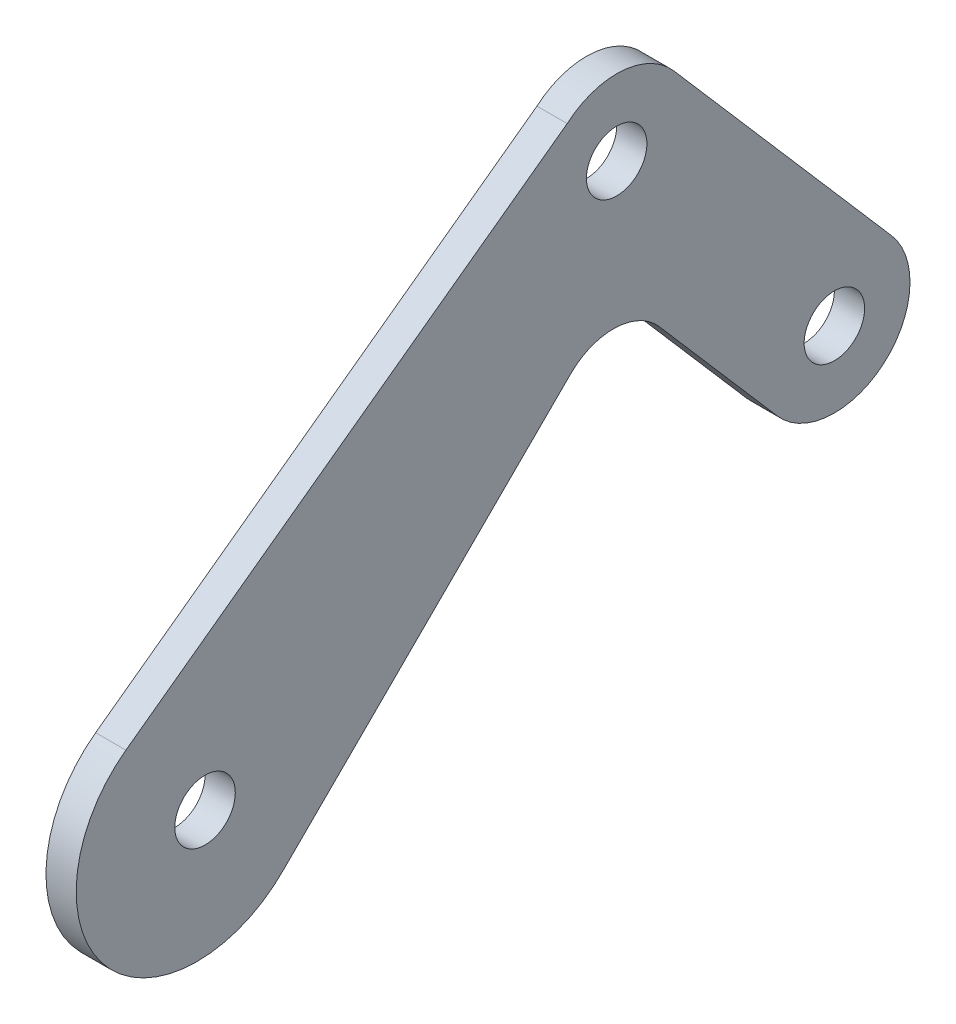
from build123d import *

# Parameters (mm, degrees)
SKETCH1_R           = 3.175
BOSS_EXTRUDE1_DEPTH = 1.5875


with BuildPart() as part:
    # Sketch1 → Boss-Extrude1 (new, symmetric)
    with BuildSketch(Plane(origin=(0, 0, 0), x_dir=(0, 0, -1), z_dir=(1, 0, 0))):
        with BuildLine():
            Line((16.854121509, -31.602185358), (4.456348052, -17.277795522))
            ThreePointArc((4.456348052, -17.277795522), (-0.109725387, -15.087769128), (-4.825463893, -16.933589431))
            Line((-4.825463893, -16.933589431), (-34.958746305, -46.936954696))
            ThreePointArc((-34.958746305, -46.936954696), (-53.641518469, -46.368768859), (-51.523775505, -27.797716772))
            Line((-51.523775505, -27.797716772), (-5.194514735, 6.001743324))
            ThreePointArc((-5.194514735, 6.001743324), (0.570796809, 7.916949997), (6.001743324, 5.194514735))
            Line((6.001743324, 5.194514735), (28.857608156, -21.213155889))
            ThreePointArc((28.857608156, -21.213155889), (28.050379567, -32.409413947), (16.854121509, -31.602185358))
        make_face()
        Circle(SKETCH1_R, mode=Mode.SUBTRACT)
        with Locations((22.855864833, -26.407670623)):
            Circle(SKETCH1_R, mode=Mode.SUBTRACT)
        with Locations((-43.212551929, -37.40050609)):
            Circle(SKETCH1_R, mode=Mode.SUBTRACT)
    extrude(amount=BOSS_EXTRUDE1_DEPTH, both=True)


solid = part.part
